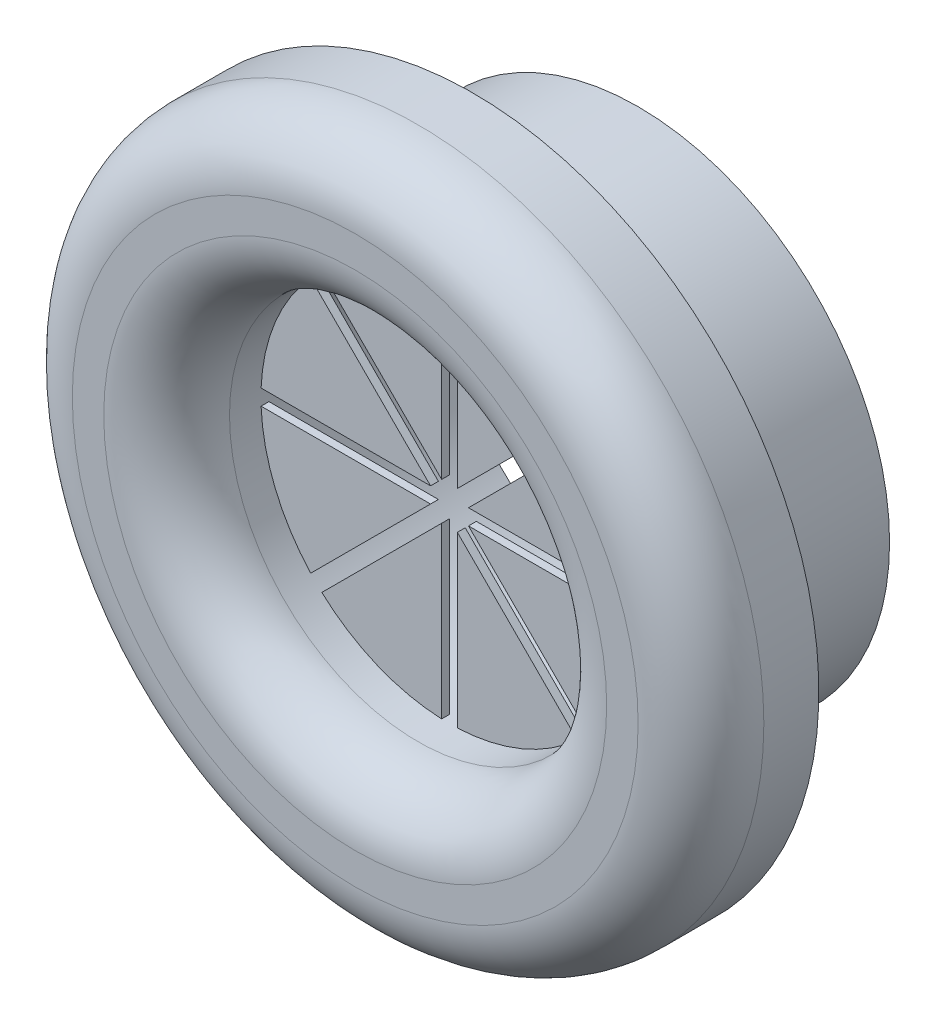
ISO-10303-21;
HEADER;
FILE_DESCRIPTION(('STEP AP214'),'2;1');
FILE_NAME('part.step','',(''),(''),'','','');
FILE_SCHEMA(('AUTOMOTIVE_DESIGN { 1 0 10303 214 1 1 1 1 }'));
ENDSEC;
DATA;
#1=APPLICATION_CONTEXT('core data for automotive mechanical design processes');
#2=APPLICATION_PROTOCOL_DEFINITION('international standard','automotive_design',2000,#1);
#3=PRODUCT_CONTEXT('',#1,'mechanical');
#4=PRODUCT('Part','Part','',(#3));
#5=PRODUCT_RELATED_PRODUCT_CATEGORY('part','',(#4));
#6=PRODUCT_DEFINITION_FORMATION('','',#4);
#7=PRODUCT_DEFINITION_CONTEXT('part definition',#1,'design');
#8=PRODUCT_DEFINITION('design','',#6,#7);
#9=PRODUCT_DEFINITION_SHAPE('','',#8);
#10=(LENGTH_UNIT() NAMED_UNIT(*) SI_UNIT(.MILLI.,.METRE.));
#11=(NAMED_UNIT(*) PLANE_ANGLE_UNIT() SI_UNIT($,.RADIAN.));
#12=(NAMED_UNIT(*) SI_UNIT($,.STERADIAN.) SOLID_ANGLE_UNIT());
#13=UNCERTAINTY_MEASURE_WITH_UNIT(LENGTH_MEASURE(1.E-05),#10,'distance_accuracy_value','');
#14=(GEOMETRIC_REPRESENTATION_CONTEXT(3) GLOBAL_UNCERTAINTY_ASSIGNED_CONTEXT((#13)) GLOBAL_UNIT_ASSIGNED_CONTEXT((#10,
#11,#12)) REPRESENTATION_CONTEXT('',''));
#15=CARTESIAN_POINT('',(0.,0.,0.));
#16=DIRECTION('',(0.,0.,1.));
#17=DIRECTION('',(1.,0.,0.));
#18=AXIS2_PLACEMENT_3D('',#15,#16,#17);
#19=CARTESIAN_POINT('',(0.,0.,9.));
#20=DIRECTION('',(0.,0.,-1.));
#21=DIRECTION('',(-1.,0.,0.));
#22=AXIS2_PLACEMENT_3D('',#19,#20,#21);
#23=CYLINDRICAL_SURFACE('',#22,11.);
#24=CARTESIAN_POINT('',(0.,0.,7.));
#25=DIRECTION('',(0.,0.,1.));
#26=DIRECTION('',(1.,0.,0.));
#27=AXIS2_PLACEMENT_3D('',#24,#25,#26);
#28=CIRCLE('',#27,11.);
#29=CARTESIAN_POINT('',(11.,0.,7.));
#30=VERTEX_POINT('',#29);
#31=EDGE_CURVE('E11',#30,#30,#28,.F.);
#32=ORIENTED_EDGE('',*,*,#31,.T.);
#33=EDGE_LOOP('',(#32));
#34=FACE_BOUND('',#33,.T.);
#35=CARTESIAN_POINT('',(0.,0.,5.25));
#36=DIRECTION('',(0.,0.,-1.));
#37=DIRECTION('',(-1.,0.,0.));
#38=AXIS2_PLACEMENT_3D('',#35,#36,#37);
#39=CIRCLE('',#38,11.);
#40=CARTESIAN_POINT('',(-11.,0.,5.25));
#41=VERTEX_POINT('',#40);
#42=EDGE_CURVE('E214',#41,#41,#39,.T.);
#43=ORIENTED_EDGE('',*,*,#42,.F.);
#44=EDGE_LOOP('',(#43));
#45=FACE_BOUND('',#44,.T.);
#46=ADVANCED_FACE('F33',(#34,#45),#23,.T.);
#47=CARTESIAN_POINT('',(0.,0.,5.));
#48=DIRECTION('',(0.,0.,1.));
#49=DIRECTION('',(1.,0.,0.));
#50=AXIS2_PLACEMENT_3D('',#47,#48,#49);
#51=PLANE('',#50);
#52=CARTESIAN_POINT('',(0.,0.,5.));
#53=DIRECTION('',(0.,0.,1.));
#54=DIRECTION('',(1.,0.,0.));
#55=AXIS2_PLACEMENT_3D('',#52,#53,#54);
#56=CIRCLE('',#55,8.);
#57=CARTESIAN_POINT('',(8.,0.,5.));
#58=VERTEX_POINT('',#57);
#59=EDGE_CURVE('E395',#58,#58,#56,.T.);
#60=ORIENTED_EDGE('',*,*,#59,.T.);
#61=EDGE_LOOP('',(#60));
#62=FACE_BOUND('',#61,.T.);
#63=CARTESIAN_POINT('',(0.,0.,5.));
#64=DIRECTION('',(0.,0.,-1.));
#65=DIRECTION('',(-1.,0.,0.));
#66=AXIS2_PLACEMENT_3D('',#63,#64,#65);
#67=CIRCLE('',#66,10.);
#68=CARTESIAN_POINT('',(-10.,0.,5.));
#69=VERTEX_POINT('',#68);
#70=EDGE_CURVE('E585',#69,#69,#67,.T.);
#71=ORIENTED_EDGE('',*,*,#70,.T.);
#72=EDGE_LOOP('',(#71));
#73=FACE_BOUND('',#72,.T.);
#74=ADVANCED_FACE('F430',(#62,#73),#51,.F.);
#75=CARTESIAN_POINT('',(0.,0.,5.));
#76=DIRECTION('',(0.,0.,-1.));
#77=DIRECTION('',(-1.,0.,0.));
#78=AXIS2_PLACEMENT_3D('',#75,#76,#77);
#79=CYLINDRICAL_SURFACE('',#78,8.);
#80=ORIENTED_EDGE('',*,*,#59,.F.);
#81=EDGE_LOOP('',(#80));
#82=FACE_BOUND('',#81,.T.);
#83=CARTESIAN_POINT('',(0.,0.,0.));
#84=DIRECTION('',(0.,0.,1.));
#85=DIRECTION('',(1.,0.,0.));
#86=AXIS2_PLACEMENT_3D('',#83,#84,#85);
#87=CIRCLE('',#86,8.);
#88=CARTESIAN_POINT('',(8.,0.,0.));
#89=VERTEX_POINT('',#88);
#90=EDGE_CURVE('E394',#89,#89,#87,.T.);
#91=ORIENTED_EDGE('',*,*,#90,.T.);
#92=EDGE_LOOP('',(#91));
#93=FACE_BOUND('',#92,.T.);
#94=ADVANCED_FACE('F425',(#82,#93),#79,.T.);
#95=CARTESIAN_POINT('',(0.,0.,0.));
#96=DIRECTION('',(0.,0.,1.));
#97=DIRECTION('',(1.,0.,0.));
#98=AXIS2_PLACEMENT_3D('',#95,#96,#97);
#99=PLANE('',#98);
#100=CARTESIAN_POINT('',(0.,0.,0.));
#101=DIRECTION('',(0.,0.,1.));
#102=DIRECTION('',(1.,0.,0.));
#103=AXIS2_PLACEMENT_3D('',#100,#101,#102);
#104=CIRCLE('',#103,6.);
#105=CARTESIAN_POINT('',(6.,0.,0.));
#106=VERTEX_POINT('',#105);
#107=EDGE_CURVE('E387',#106,#106,#104,.T.);
#108=ORIENTED_EDGE('',*,*,#107,.T.);
#109=EDGE_LOOP('',(#108));
#110=FACE_BOUND('',#109,.T.);
#111=ORIENTED_EDGE('',*,*,#90,.F.);
#112=EDGE_LOOP('',(#111));
#113=FACE_BOUND('',#112,.T.);
#114=ADVANCED_FACE('F422',(#110,#113),#99,.F.);
#115=CARTESIAN_POINT('',(0.,0.,9.));
#116=DIRECTION('',(0.,0.,1.));
#117=DIRECTION('',(1.,0.,0.));
#118=AXIS2_PLACEMENT_3D('',#115,#116,#117);
#119=PLANE('',#118);
#120=CARTESIAN_POINT('',(0.,0.,9.));
#121=DIRECTION('',(0.,0.,1.));
#122=DIRECTION('',(1.,0.,0.));
#123=AXIS2_PLACEMENT_3D('',#120,#121,#122);
#124=CIRCLE('',#123,8.);
#125=CARTESIAN_POINT('',(8.,0.,9.));
#126=VERTEX_POINT('',#125);
#127=EDGE_CURVE('E41',#126,#126,#124,.F.);
#128=ORIENTED_EDGE('',*,*,#127,.T.);
#129=EDGE_LOOP('',(#128));
#130=FACE_BOUND('',#129,.T.);
#131=CARTESIAN_POINT('',(0.,0.,9.));
#132=DIRECTION('',(0.,0.,1.));
#133=DIRECTION('',(1.,0.,0.));
#134=AXIS2_PLACEMENT_3D('',#131,#132,#133);
#135=CIRCLE('',#134,9.);
#136=CARTESIAN_POINT('',(9.,0.,9.));
#137=VERTEX_POINT('',#136);
#138=EDGE_CURVE('E403',#137,#137,#135,.T.);
#139=ORIENTED_EDGE('',*,*,#138,.T.);
#140=EDGE_LOOP('',(#139));
#141=FACE_BOUND('',#140,.T.);
#142=ADVANCED_FACE('F408',(#130,#141),#119,.T.);
#143=CARTESIAN_POINT('',(0.,0.,0.));
#144=DIRECTION('',(0.,0.,1.));
#145=DIRECTION('',(1.,0.,0.));
#146=AXIS2_PLACEMENT_3D('',#143,#144,#145);
#147=CYLINDRICAL_SURFACE('',#146,6.);
#148=DIRECTION('',(0.,0.,1.));
#149=VECTOR('',#148,1.);
#150=CARTESIAN_POINT('',(-4.41573293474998,4.0621795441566,5.75000000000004));
#151=LINE('',#150,#149);
#152=CARTESIAN_POINT('',(-4.41573293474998,4.0621795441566,5.75));
#153=VERTEX_POINT('',#152);
#154=CARTESIAN_POINT('',(-4.41573293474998,4.0621795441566,6.00000000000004));
#155=VERTEX_POINT('',#154);
#156=EDGE_CURVE('E53',#153,#155,#151,.T.);
#157=ORIENTED_EDGE('',*,*,#156,.F.);
#158=CARTESIAN_POINT('',(0.,0.,5.75));
#159=DIRECTION('',(0.,0.,-1.));
#160=DIRECTION('',(-0.707106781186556,0.707106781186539,0.));
#161=AXIS2_PLACEMENT_3D('',#158,#159,#160);
#162=CIRCLE('',#161,6.00000000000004);
#163=CARTESIAN_POINT('',(-5.9947894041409,0.249999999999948,5.75));
#164=VERTEX_POINT('',#163);
#165=EDGE_CURVE('E48',#164,#153,#162,.T.);
#166=ORIENTED_EDGE('',*,*,#165,.F.);
#167=DIRECTION('',(0.,0.,1.));
#168=VECTOR('',#167,1.);
#169=CARTESIAN_POINT('',(-5.99478940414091,0.24999999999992,5.75000000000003));
#170=LINE('',#169,#168);
#171=CARTESIAN_POINT('',(-5.99478940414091,0.249999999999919,6.00000000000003));
#172=VERTEX_POINT('',#171);
#173=EDGE_CURVE('E209',#164,#172,#170,.T.);
#174=ORIENTED_EDGE('',*,*,#173,.T.);
#175=CARTESIAN_POINT('',(0.,0.,6.));
#176=DIRECTION('',(0.,0.,-1.));
#177=DIRECTION('',(-0.707106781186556,0.707106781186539,0.));
#178=AXIS2_PLACEMENT_3D('',#175,#176,#177);
#179=CIRCLE('',#178,6.00000000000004);
#180=EDGE_CURVE('E210',#172,#155,#179,.T.);
#181=ORIENTED_EDGE('',*,*,#180,.T.);
#182=EDGE_LOOP('',(#157,#166,#174,#181));
#183=FACE_BOUND('',#182,.T.);
#184=DIRECTION('',(0.,0.,1.));
#185=VECTOR('',#184,1.);
#186=CARTESIAN_POINT('',(-0.250000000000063,5.9947894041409,5.75000000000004));
#187=LINE('',#186,#185);
#188=CARTESIAN_POINT('',(-0.250000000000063,5.9947894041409,5.75));
#189=VERTEX_POINT('',#188);
#190=CARTESIAN_POINT('',(-0.250000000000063,5.9947894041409,6.00000000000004));
#191=VERTEX_POINT('',#190);
#192=EDGE_CURVE('E244',#189,#191,#187,.T.);
#193=ORIENTED_EDGE('',*,*,#192,.F.);
#194=CARTESIAN_POINT('',(0.,0.,5.75));
#195=DIRECTION('',(0.,0.,-1.));
#196=DIRECTION('',(0.,1.,0.));
#197=AXIS2_PLACEMENT_3D('',#194,#195,#196);
#198=CIRCLE('',#197,6.00000000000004);
#199=CARTESIAN_POINT('',(-4.06217954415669,4.4157329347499,5.75));
#200=VERTEX_POINT('',#199);
#201=EDGE_CURVE('E231',#200,#189,#198,.T.);
#202=ORIENTED_EDGE('',*,*,#201,.F.);
#203=DIRECTION('',(0.,0.,1.));
#204=VECTOR('',#203,1.);
#205=CARTESIAN_POINT('',(-4.06217954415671,4.41573293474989,5.75000000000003));
#206=LINE('',#205,#204);
#207=CARTESIAN_POINT('',(-4.06217954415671,4.41573293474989,6.00000000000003));
#208=VERTEX_POINT('',#207);
#209=EDGE_CURVE('E241',#200,#208,#206,.T.);
#210=ORIENTED_EDGE('',*,*,#209,.T.);
#211=CARTESIAN_POINT('',(0.,0.,6.));
#212=DIRECTION('',(0.,0.,-1.));
#213=DIRECTION('',(0.,1.,0.));
#214=AXIS2_PLACEMENT_3D('',#211,#212,#213);
#215=CIRCLE('',#214,6.00000000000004);
#216=EDGE_CURVE('E228',#208,#191,#215,.T.);
#217=ORIENTED_EDGE('',*,*,#216,.T.);
#218=EDGE_LOOP('',(#193,#202,#210,#217));
#219=FACE_BOUND('',#218,.T.);
#220=DIRECTION('',(0.,0.,1.));
#221=VECTOR('',#220,1.);
#222=CARTESIAN_POINT('',(4.06217954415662,4.41573293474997,5.75000000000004));
#223=LINE('',#222,#221);
#224=CARTESIAN_POINT('',(4.06217954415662,4.41573293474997,5.75));
#225=VERTEX_POINT('',#224);
#226=CARTESIAN_POINT('',(4.06217954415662,4.41573293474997,6.00000000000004));
#227=VERTEX_POINT('',#226);
#228=EDGE_CURVE('E268',#225,#227,#223,.T.);
#229=ORIENTED_EDGE('',*,*,#228,.F.);
#230=CARTESIAN_POINT('',(0.,0.,5.75));
#231=DIRECTION('',(0.,0.,-1.));
#232=DIRECTION('',(0.707106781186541,0.707106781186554,0.));
#233=AXIS2_PLACEMENT_3D('',#230,#231,#232);
#234=CIRCLE('',#233,6.00000000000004);
#235=CARTESIAN_POINT('',(0.249999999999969,5.9947894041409,5.75));
#236=VERTEX_POINT('',#235);
#237=EDGE_CURVE('E255',#236,#225,#234,.T.);
#238=ORIENTED_EDGE('',*,*,#237,.F.);
#239=DIRECTION('',(0.,0.,1.));
#240=VECTOR('',#239,1.);
#241=CARTESIAN_POINT('',(0.249999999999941,5.99478940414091,5.75000000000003));
#242=LINE('',#241,#240);
#243=CARTESIAN_POINT('',(0.249999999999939,5.99478940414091,6.00000000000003));
#244=VERTEX_POINT('',#243);
#245=EDGE_CURVE('E265',#236,#244,#242,.T.);
#246=ORIENTED_EDGE('',*,*,#245,.T.);
#247=CARTESIAN_POINT('',(0.,0.,6.));
#248=DIRECTION('',(0.,0.,-1.));
#249=DIRECTION('',(0.707106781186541,0.707106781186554,0.));
#250=AXIS2_PLACEMENT_3D('',#247,#248,#249);
#251=CIRCLE('',#250,6.00000000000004);
#252=EDGE_CURVE('E252',#244,#227,#251,.T.);
#253=ORIENTED_EDGE('',*,*,#252,.T.);
#254=EDGE_LOOP('',(#229,#238,#246,#253));
#255=FACE_BOUND('',#254,.T.);
#256=DIRECTION('',(0.,0.,1.));
#257=VECTOR('',#256,1.);
#258=CARTESIAN_POINT('',(5.9947894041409,0.25,5.75000000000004));
#259=LINE('',#258,#257);
#260=CARTESIAN_POINT('',(5.9947894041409,0.25,5.75));
#261=VERTEX_POINT('',#260);
#262=CARTESIAN_POINT('',(5.9947894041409,0.25,6.00000000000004));
#263=VERTEX_POINT('',#262);
#264=EDGE_CURVE('E292',#261,#263,#259,.T.);
#265=ORIENTED_EDGE('',*,*,#264,.F.);
#266=CARTESIAN_POINT('',(0.,0.,5.75));
#267=DIRECTION('',(0.,0.,-1.));
#268=DIRECTION('',(1.,0.,0.));
#269=AXIS2_PLACEMENT_3D('',#266,#267,#268);
#270=CIRCLE('',#269,6.00000000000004);
#271=CARTESIAN_POINT('',(4.41573293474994,4.06217954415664,5.75));
#272=VERTEX_POINT('',#271);
#273=EDGE_CURVE('E279',#272,#261,#270,.T.);
#274=ORIENTED_EDGE('',*,*,#273,.F.);
#275=DIRECTION('',(0.,0.,1.));
#276=VECTOR('',#275,1.);
#277=CARTESIAN_POINT('',(4.41573293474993,4.06217954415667,5.75000000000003));
#278=LINE('',#277,#276);
#279=CARTESIAN_POINT('',(4.41573293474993,4.06217954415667,6.00000000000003));
#280=VERTEX_POINT('',#279);
#281=EDGE_CURVE('E289',#272,#280,#278,.T.);
#282=ORIENTED_EDGE('',*,*,#281,.T.);
#283=CARTESIAN_POINT('',(0.,0.,6.));
#284=DIRECTION('',(0.,0.,-1.));
#285=DIRECTION('',(1.,0.,0.));
#286=AXIS2_PLACEMENT_3D('',#283,#284,#285);
#287=CIRCLE('',#286,6.00000000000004);
#288=EDGE_CURVE('E276',#280,#263,#287,.T.);
#289=ORIENTED_EDGE('',*,*,#288,.T.);
#290=EDGE_LOOP('',(#265,#274,#282,#289));
#291=FACE_BOUND('',#290,.T.);
#292=DIRECTION('',(0.,0.,1.));
#293=VECTOR('',#292,1.);
#294=CARTESIAN_POINT('',(4.41573293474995,-4.06217954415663,5.75000000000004));
#295=LINE('',#294,#293);
#296=CARTESIAN_POINT('',(4.41573293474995,-4.06217954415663,5.75));
#297=VERTEX_POINT('',#296);
#298=CARTESIAN_POINT('',(4.41573293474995,-4.06217954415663,6.00000000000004));
#299=VERTEX_POINT('',#298);
#300=EDGE_CURVE('E316',#297,#299,#295,.T.);
#301=ORIENTED_EDGE('',*,*,#300,.F.);
#302=CARTESIAN_POINT('',(0.,0.,5.75));
#303=DIRECTION('',(0.,0.,-1.));
#304=DIRECTION('',(0.707106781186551,-0.707106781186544,0.));
#305=AXIS2_PLACEMENT_3D('',#302,#303,#304);
#306=CIRCLE('',#305,6.00000000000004);
#307=CARTESIAN_POINT('',(5.9947894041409,-0.24999999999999,5.75));
#308=VERTEX_POINT('',#307);
#309=EDGE_CURVE('E303',#308,#297,#306,.T.);
#310=ORIENTED_EDGE('',*,*,#309,.F.);
#311=DIRECTION('',(0.,0.,1.));
#312=VECTOR('',#311,1.);
#313=CARTESIAN_POINT('',(5.99478940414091,-0.249999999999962,5.75000000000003));
#314=LINE('',#313,#312);
#315=CARTESIAN_POINT('',(5.99478940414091,-0.24999999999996,6.00000000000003));
#316=VERTEX_POINT('',#315);
#317=EDGE_CURVE('E313',#308,#316,#314,.T.);
#318=ORIENTED_EDGE('',*,*,#317,.T.);
#319=CARTESIAN_POINT('',(0.,0.,6.));
#320=DIRECTION('',(0.,0.,-1.));
#321=DIRECTION('',(0.707106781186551,-0.707106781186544,0.));
#322=AXIS2_PLACEMENT_3D('',#319,#320,#321);
#323=CIRCLE('',#322,6.00000000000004);
#324=EDGE_CURVE('E300',#316,#299,#323,.T.);
#325=ORIENTED_EDGE('',*,*,#324,.T.);
#326=EDGE_LOOP('',(#301,#310,#318,#325));
#327=FACE_BOUND('',#326,.T.);
#328=DIRECTION('',(0.,0.,1.));
#329=VECTOR('',#328,1.);
#330=CARTESIAN_POINT('',(0.250000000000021,-5.9947894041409,5.75000000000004));
#331=LINE('',#330,#329);
#332=CARTESIAN_POINT('',(0.250000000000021,-5.9947894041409,5.75));
#333=VERTEX_POINT('',#332);
#334=CARTESIAN_POINT('',(0.250000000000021,-5.9947894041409,6.00000000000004));
#335=VERTEX_POINT('',#334);
#336=EDGE_CURVE('E340',#333,#335,#331,.T.);
#337=ORIENTED_EDGE('',*,*,#336,.F.);
#338=CARTESIAN_POINT('',(0.,0.,5.75));
#339=DIRECTION('',(0.,0.,-1.));
#340=DIRECTION('',(0.,-1.,0.));
#341=AXIS2_PLACEMENT_3D('',#338,#339,#340);
#342=CIRCLE('',#341,6.00000000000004);
#343=CARTESIAN_POINT('',(4.06217954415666,-4.41573293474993,5.75));
#344=VERTEX_POINT('',#343);
#345=EDGE_CURVE('E327',#344,#333,#342,.T.);
#346=ORIENTED_EDGE('',*,*,#345,.F.);
#347=DIRECTION('',(0.,0.,1.));
#348=VECTOR('',#347,1.);
#349=CARTESIAN_POINT('',(4.06217954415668,-4.41573293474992,5.75000000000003));
#350=LINE('',#349,#348);
#351=CARTESIAN_POINT('',(4.06217954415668,-4.41573293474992,6.00000000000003));
#352=VERTEX_POINT('',#351);
#353=EDGE_CURVE('E337',#344,#352,#350,.T.);
#354=ORIENTED_EDGE('',*,*,#353,.T.);
#355=CARTESIAN_POINT('',(0.,0.,6.));
#356=DIRECTION('',(0.,0.,-1.));
#357=DIRECTION('',(0.,-1.,0.));
#358=AXIS2_PLACEMENT_3D('',#355,#356,#357);
#359=CIRCLE('',#358,6.00000000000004);
#360=EDGE_CURVE('E324',#352,#335,#359,.T.);
#361=ORIENTED_EDGE('',*,*,#360,.T.);
#362=EDGE_LOOP('',(#337,#346,#354,#361));
#363=FACE_BOUND('',#362,.T.);
#364=DIRECTION('',(0.,0.,1.));
#365=VECTOR('',#364,1.);
#366=CARTESIAN_POINT('',(-4.06217954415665,-4.41573293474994,5.75000000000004));
#367=LINE('',#366,#365);
#368=CARTESIAN_POINT('',(-4.06217954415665,-4.41573293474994,5.75));
#369=VERTEX_POINT('',#368);
#370=CARTESIAN_POINT('',(-4.06217954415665,-4.41573293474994,6.00000000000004));
#371=VERTEX_POINT('',#370);
#372=EDGE_CURVE('E364',#369,#371,#367,.T.);
#373=ORIENTED_EDGE('',*,*,#372,.F.);
#374=CARTESIAN_POINT('',(0.,0.,5.75));
#375=DIRECTION('',(0.,0.,-1.));
#376=DIRECTION('',(-0.707106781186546,-0.707106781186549,0.));
#377=AXIS2_PLACEMENT_3D('',#374,#375,#376);
#378=CIRCLE('',#377,6.00000000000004);
#379=CARTESIAN_POINT('',(-0.25000000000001,-5.9947894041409,5.75));
#380=VERTEX_POINT('',#379);
#381=EDGE_CURVE('E351',#380,#369,#378,.T.);
#382=ORIENTED_EDGE('',*,*,#381,.F.);
#383=DIRECTION('',(0.,0.,1.));
#384=VECTOR('',#383,1.);
#385=CARTESIAN_POINT('',(-0.249999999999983,-5.99478940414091,5.75000000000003));
#386=LINE('',#385,#384);
#387=CARTESIAN_POINT('',(-0.249999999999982,-5.99478940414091,6.00000000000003));
#388=VERTEX_POINT('',#387);
#389=EDGE_CURVE('E361',#380,#388,#386,.T.);
#390=ORIENTED_EDGE('',*,*,#389,.T.);
#391=CARTESIAN_POINT('',(0.,0.,6.));
#392=DIRECTION('',(0.,0.,-1.));
#393=DIRECTION('',(-0.707106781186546,-0.707106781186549,0.));
#394=AXIS2_PLACEMENT_3D('',#391,#392,#393);
#395=CIRCLE('',#394,6.00000000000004);
#396=EDGE_CURVE('E348',#388,#371,#395,.T.);
#397=ORIENTED_EDGE('',*,*,#396,.T.);
#398=EDGE_LOOP('',(#373,#382,#390,#397));
#399=FACE_BOUND('',#398,.T.);
#400=DIRECTION('',(0.,0.,1.));
#401=VECTOR('',#400,1.);
#402=CARTESIAN_POINT('',(-5.9947894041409,-0.25,5.75000000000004));
#403=LINE('',#402,#401);
#404=CARTESIAN_POINT('',(-5.9947894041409,-0.25,5.75));
#405=VERTEX_POINT('',#404);
#406=CARTESIAN_POINT('',(-5.9947894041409,-0.25,6.00000000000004));
#407=VERTEX_POINT('',#406);
#408=EDGE_CURVE('E388',#405,#407,#403,.T.);
#409=ORIENTED_EDGE('',*,*,#408,.F.);
#410=CARTESIAN_POINT('',(0.,0.,5.75));
#411=DIRECTION('',(0.,0.,-1.));
#412=DIRECTION('',(-1.,0.,0.));
#413=AXIS2_PLACEMENT_3D('',#410,#411,#412);
#414=CIRCLE('',#413,6.00000000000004);
#415=CARTESIAN_POINT('',(-4.41573293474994,-4.06217954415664,5.75));
#416=VERTEX_POINT('',#415);
#417=EDGE_CURVE('E375',#416,#405,#414,.T.);
#418=ORIENTED_EDGE('',*,*,#417,.F.);
#419=DIRECTION('',(0.,0.,1.));
#420=VECTOR('',#419,1.);
#421=CARTESIAN_POINT('',(-4.41573293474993,-4.06217954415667,5.75000000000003));
#422=LINE('',#421,#420);
#423=CARTESIAN_POINT('',(-4.41573293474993,-4.06217954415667,6.00000000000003));
#424=VERTEX_POINT('',#423);
#425=EDGE_CURVE('E385',#416,#424,#422,.T.);
#426=ORIENTED_EDGE('',*,*,#425,.T.);
#427=CARTESIAN_POINT('',(0.,0.,6.));
#428=DIRECTION('',(0.,0.,-1.));
#429=DIRECTION('',(-1.,0.,0.));
#430=AXIS2_PLACEMENT_3D('',#427,#428,#429);
#431=CIRCLE('',#430,6.00000000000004);
#432=EDGE_CURVE('E372',#424,#407,#431,.T.);
#433=ORIENTED_EDGE('',*,*,#432,.T.);
#434=EDGE_LOOP('',(#409,#418,#426,#433));
#435=FACE_BOUND('',#434,.T.);
#436=CARTESIAN_POINT('',(0.,0.,7.));
#437=DIRECTION('',(0.,0.,1.));
#438=DIRECTION('',(1.,0.,0.));
#439=AXIS2_PLACEMENT_3D('',#436,#437,#438);
#440=CIRCLE('',#439,6.);
#441=CARTESIAN_POINT('',(6.,0.,7.));
#442=VERTEX_POINT('',#441);
#443=EDGE_CURVE('E398',#442,#442,#440,.T.);
#444=ORIENTED_EDGE('',*,*,#443,.T.);
#445=EDGE_LOOP('',(#444));
#446=FACE_BOUND('',#445,.T.);
#447=ORIENTED_EDGE('',*,*,#107,.F.);
#448=EDGE_LOOP('',(#447));
#449=FACE_BOUND('',#448,.T.);
#450=ADVANCED_FACE('F414',(#183,#219,#255,#291,#327,#363,#399,#435,#446,#449),#147,.F.);
#451=CARTESIAN_POINT('',(0.,0.,7.));
#452=DIRECTION('',(0.,0.,1.));
#453=DIRECTION('',(1.,0.,0.));
#454=AXIS2_PLACEMENT_3D('',#451,#452,#453);
#455=TOROIDAL_SURFACE('',#454,8.,2.);
#456=ORIENTED_EDGE('',*,*,#127,.F.);
#457=EDGE_LOOP('',(#456));
#458=FACE_BOUND('',#457,.T.);
#459=ORIENTED_EDGE('',*,*,#443,.F.);
#460=EDGE_LOOP('',(#459));
#461=FACE_BOUND('',#460,.T.);
#462=ADVANCED_FACE('F411',(#458,#461),#455,.T.);
#463=CARTESIAN_POINT('',(0.,0.,7.));
#464=DIRECTION('',(0.,0.,1.));
#465=DIRECTION('',(1.,0.,0.));
#466=AXIS2_PLACEMENT_3D('',#463,#464,#465);
#467=TOROIDAL_SURFACE('',#466,9.,2.);
#468=ORIENTED_EDGE('',*,*,#31,.F.);
#469=EDGE_LOOP('',(#468));
#470=FACE_BOUND('',#469,.T.);
#471=ORIENTED_EDGE('',*,*,#138,.F.);
#472=EDGE_LOOP('',(#471));
#473=FACE_BOUND('',#472,.T.);
#474=ADVANCED_FACE('F35',(#470,#473),#467,.T.);
#475=CARTESIAN_POINT('',(-4.41573293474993,-4.06217954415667,5.75000000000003));
#476=DIRECTION('',(0.707106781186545,-0.70710678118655,0.));
#477=DIRECTION('',(0.70710678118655,0.707106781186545,0.));
#478=AXIS2_PLACEMENT_3D('',#475,#476,#477);
#479=PLANE('',#478);
#480=DIRECTION('',(0.70710678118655,0.707106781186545,0.));
#481=VECTOR('',#480,1.);
#482=CARTESIAN_POINT('',(-4.41573293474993,-4.06217954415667,6.00000000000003));
#483=LINE('',#482,#481);
#484=CARTESIAN_POINT('',(-0.603553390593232,-0.25,6.));
#485=VERTEX_POINT('',#484);
#486=EDGE_CURVE('E363',#424,#485,#483,.T.);
#487=ORIENTED_EDGE('',*,*,#486,.F.);
#488=ORIENTED_EDGE('',*,*,#425,.F.);
#489=DIRECTION('',(0.70710678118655,0.707106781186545,0.));
#490=VECTOR('',#489,1.);
#491=CARTESIAN_POINT('',(-4.41573293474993,-4.06217954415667,5.75000000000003));
#492=LINE('',#491,#490);
#493=CARTESIAN_POINT('',(-0.603553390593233,-0.25,5.75));
#494=VERTEX_POINT('',#493);
#495=EDGE_CURVE('E368',#416,#494,#492,.T.);
#496=ORIENTED_EDGE('',*,*,#495,.T.);
#497=DIRECTION('',(0.,0.,1.));
#498=VECTOR('',#497,1.);
#499=CARTESIAN_POINT('',(-0.603553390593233,-0.25,5.75));
#500=LINE('',#499,#498);
#501=EDGE_CURVE('E378',#494,#485,#500,.T.);
#502=ORIENTED_EDGE('',*,*,#501,.T.);
#503=EDGE_LOOP('',(#487,#488,#496,#502));
#504=FACE_BOUND('',#503,.T.);
#505=ADVANCED_FACE('F448',(#504),#479,.T.);
#506=CARTESIAN_POINT('',(-0.603553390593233,-0.25,5.75));
#507=DIRECTION('',(0.,1.,0.));
#508=DIRECTION('',(-1.,0.,0.));
#509=AXIS2_PLACEMENT_3D('',#506,#507,#508);
#510=PLANE('',#509);
#511=DIRECTION('',(-1.,0.,0.));
#512=VECTOR('',#511,1.);
#513=CARTESIAN_POINT('',(-0.603553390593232,-0.25,6.));
#514=LINE('',#513,#512);
#515=EDGE_CURVE('E381',#485,#407,#514,.T.);
#516=ORIENTED_EDGE('',*,*,#515,.F.);
#517=ORIENTED_EDGE('',*,*,#501,.F.);
#518=DIRECTION('',(-1.,0.,0.));
#519=VECTOR('',#518,1.);
#520=CARTESIAN_POINT('',(-0.603553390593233,-0.25,5.75));
#521=LINE('',#520,#519);
#522=EDGE_CURVE('E371',#494,#405,#521,.T.);
#523=ORIENTED_EDGE('',*,*,#522,.T.);
#524=ORIENTED_EDGE('',*,*,#408,.T.);
#525=EDGE_LOOP('',(#516,#517,#523,#524));
#526=FACE_BOUND('',#525,.T.);
#527=ADVANCED_FACE('F451',(#526),#510,.T.);
#528=CARTESIAN_POINT('',(0.,0.,5.75));
#529=DIRECTION('',(0.,0.,-1.));
#530=DIRECTION('',(-1.,0.,0.));
#531=AXIS2_PLACEMENT_3D('',#528,#529,#530);
#532=PLANE('',#531);
#533=ORIENTED_EDGE('',*,*,#495,.F.);
#534=ORIENTED_EDGE('',*,*,#417,.T.);
#535=ORIENTED_EDGE('',*,*,#522,.F.);
#536=EDGE_LOOP('',(#533,#534,#535));
#537=FACE_BOUND('',#536,.T.);
#538=ADVANCED_FACE('F455',(#537),#532,.T.);
#539=CARTESIAN_POINT('',(0.,0.,6.));
#540=DIRECTION('',(0.,0.,-1.));
#541=DIRECTION('',(-1.,0.,0.));
#542=AXIS2_PLACEMENT_3D('',#539,#540,#541);
#543=PLANE('',#542);
#544=ORIENTED_EDGE('',*,*,#486,.T.);
#545=ORIENTED_EDGE('',*,*,#515,.T.);
#546=ORIENTED_EDGE('',*,*,#432,.F.);
#547=EDGE_LOOP('',(#544,#545,#546));
#548=FACE_BOUND('',#547,.T.);
#549=ADVANCED_FACE('F457',(#548),#543,.F.);
#550=CARTESIAN_POINT('',(-0.249999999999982,-5.99478940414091,5.75000000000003));
#551=DIRECTION('',(1.,0.,0.));
#552=DIRECTION('',(0.,0.,-1.));
#553=AXIS2_PLACEMENT_3D('',#550,#551,#552);
#554=PLANE('',#553);
#555=DIRECTION('',(0.,1.,0.));
#556=VECTOR('',#555,1.);
#557=CARTESIAN_POINT('',(-0.249999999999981,-5.99478940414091,6.00000000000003));
#558=LINE('',#557,#556);
#559=CARTESIAN_POINT('',(-0.249999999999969,-0.603553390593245,6.));
#560=VERTEX_POINT('',#559);
#561=EDGE_CURVE('E339',#388,#560,#558,.T.);
#562=ORIENTED_EDGE('',*,*,#561,.F.);
#563=ORIENTED_EDGE('',*,*,#389,.F.);
#564=DIRECTION('',(0.,1.,0.));
#565=VECTOR('',#564,1.);
#566=CARTESIAN_POINT('',(-0.249999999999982,-5.99478940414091,5.75000000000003));
#567=LINE('',#566,#565);
#568=CARTESIAN_POINT('',(-0.24999999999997,-0.603553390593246,5.75));
#569=VERTEX_POINT('',#568);
#570=EDGE_CURVE('E344',#380,#569,#567,.T.);
#571=ORIENTED_EDGE('',*,*,#570,.T.);
#572=DIRECTION('',(0.,0.,1.));
#573=VECTOR('',#572,1.);
#574=CARTESIAN_POINT('',(-0.24999999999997,-0.603553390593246,5.75));
#575=LINE('',#574,#573);
#576=EDGE_CURVE('E354',#569,#560,#575,.T.);
#577=ORIENTED_EDGE('',*,*,#576,.T.);
#578=EDGE_LOOP('',(#562,#563,#571,#577));
#579=FACE_BOUND('',#578,.T.);
#580=ADVANCED_FACE('F460',(#579),#554,.T.);
#581=CARTESIAN_POINT('',(-0.24999999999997,-0.603553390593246,5.75));
#582=DIRECTION('',(-0.707106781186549,0.707106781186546,0.));
#583=DIRECTION('',(-0.707106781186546,-0.707106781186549,0.));
#584=AXIS2_PLACEMENT_3D('',#581,#582,#583);
#585=PLANE('',#584);
#586=DIRECTION('',(-0.707106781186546,-0.707106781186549,0.));
#587=VECTOR('',#586,1.);
#588=CARTESIAN_POINT('',(-0.249999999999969,-0.603553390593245,6.));
#589=LINE('',#588,#587);
#590=EDGE_CURVE('E357',#560,#371,#589,.T.);
#591=ORIENTED_EDGE('',*,*,#590,.F.);
#592=ORIENTED_EDGE('',*,*,#576,.F.);
#593=DIRECTION('',(-0.707106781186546,-0.707106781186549,0.));
#594=VECTOR('',#593,1.);
#595=CARTESIAN_POINT('',(-0.24999999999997,-0.603553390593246,5.75));
#596=LINE('',#595,#594);
#597=EDGE_CURVE('E347',#569,#369,#596,.T.);
#598=ORIENTED_EDGE('',*,*,#597,.T.);
#599=ORIENTED_EDGE('',*,*,#372,.T.);
#600=EDGE_LOOP('',(#591,#592,#598,#599));
#601=FACE_BOUND('',#600,.T.);
#602=ADVANCED_FACE('F467',(#601),#585,.T.);
#603=CARTESIAN_POINT('',(0.,0.,5.75));
#604=DIRECTION('',(0.,0.,-1.));
#605=DIRECTION('',(-0.707106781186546,-0.707106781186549,0.));
#606=AXIS2_PLACEMENT_3D('',#603,#604,#605);
#607=PLANE('',#606);
#608=ORIENTED_EDGE('',*,*,#570,.F.);
#609=ORIENTED_EDGE('',*,*,#381,.T.);
#610=ORIENTED_EDGE('',*,*,#597,.F.);
#611=EDGE_LOOP('',(#608,#609,#610));
#612=FACE_BOUND('',#611,.T.);
#613=ADVANCED_FACE('F471',(#612),#607,.T.);
#614=CARTESIAN_POINT('',(0.,0.,6.));
#615=DIRECTION('',(0.,0.,-1.));
#616=DIRECTION('',(-0.707106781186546,-0.707106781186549,0.));
#617=AXIS2_PLACEMENT_3D('',#614,#615,#616);
#618=PLANE('',#617);
#619=ORIENTED_EDGE('',*,*,#561,.T.);
#620=ORIENTED_EDGE('',*,*,#590,.T.);
#621=ORIENTED_EDGE('',*,*,#396,.F.);
#622=EDGE_LOOP('',(#619,#620,#621));
#623=FACE_BOUND('',#622,.T.);
#624=ADVANCED_FACE('F473',(#623),#618,.F.);
#625=CARTESIAN_POINT('',(4.06217954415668,-4.41573293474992,5.75000000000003));
#626=DIRECTION('',(0.707106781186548,0.707106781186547,0.));
#627=DIRECTION('',(-0.707106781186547,0.707106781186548,0.));
#628=AXIS2_PLACEMENT_3D('',#625,#626,#627);
#629=PLANE('',#628);
#630=DIRECTION('',(-0.707106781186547,0.707106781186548,0.));
#631=VECTOR('',#630,1.);
#632=CARTESIAN_POINT('',(4.06217954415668,-4.41573293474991,6.00000000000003));
#633=LINE('',#632,#631);
#634=CARTESIAN_POINT('',(0.250000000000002,-0.603553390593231,6.));
#635=VERTEX_POINT('',#634);
#636=EDGE_CURVE('E315',#352,#635,#633,.T.);
#637=ORIENTED_EDGE('',*,*,#636,.F.);
#638=ORIENTED_EDGE('',*,*,#353,.F.);
#639=DIRECTION('',(-0.707106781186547,0.707106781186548,0.));
#640=VECTOR('',#639,1.);
#641=CARTESIAN_POINT('',(4.06217954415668,-4.41573293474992,5.75000000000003));
#642=LINE('',#641,#640);
#643=CARTESIAN_POINT('',(0.250000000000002,-0.603553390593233,5.75));
#644=VERTEX_POINT('',#643);
#645=EDGE_CURVE('E320',#344,#644,#642,.T.);
#646=ORIENTED_EDGE('',*,*,#645,.T.);
#647=DIRECTION('',(0.,0.,1.));
#648=VECTOR('',#647,1.);
#649=CARTESIAN_POINT('',(0.250000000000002,-0.603553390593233,5.75));
#650=LINE('',#649,#648);
#651=EDGE_CURVE('E330',#644,#635,#650,.T.);
#652=ORIENTED_EDGE('',*,*,#651,.T.);
#653=EDGE_LOOP('',(#637,#638,#646,#652));
#654=FACE_BOUND('',#653,.T.);
#655=ADVANCED_FACE('F476',(#654),#629,.T.);
#656=CARTESIAN_POINT('',(0.250000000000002,-0.603553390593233,5.75));
#657=DIRECTION('',(-1.,0.,0.));
#658=DIRECTION('',(0.,-1.,0.));
#659=AXIS2_PLACEMENT_3D('',#656,#657,#658);
#660=PLANE('',#659);
#661=DIRECTION('',(0.,-1.,0.));
#662=VECTOR('',#661,1.);
#663=CARTESIAN_POINT('',(0.250000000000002,-0.603553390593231,6.));
#664=LINE('',#663,#662);
#665=EDGE_CURVE('E333',#635,#335,#664,.T.);
#666=ORIENTED_EDGE('',*,*,#665,.F.);
#667=ORIENTED_EDGE('',*,*,#651,.F.);
#668=DIRECTION('',(0.,-1.,0.));
#669=VECTOR('',#668,1.);
#670=CARTESIAN_POINT('',(0.250000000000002,-0.603553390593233,5.75));
#671=LINE('',#670,#669);
#672=EDGE_CURVE('E323',#644,#333,#671,.T.);
#673=ORIENTED_EDGE('',*,*,#672,.T.);
#674=ORIENTED_EDGE('',*,*,#336,.T.);
#675=EDGE_LOOP('',(#666,#667,#673,#674));
#676=FACE_BOUND('',#675,.T.);
#677=ADVANCED_FACE('F483',(#676),#660,.T.);
#678=CARTESIAN_POINT('',(0.,0.,5.75));
#679=DIRECTION('',(0.,0.,-1.));
#680=DIRECTION('',(0.,-1.,0.));
#681=AXIS2_PLACEMENT_3D('',#678,#679,#680);
#682=PLANE('',#681);
#683=ORIENTED_EDGE('',*,*,#645,.F.);
#684=ORIENTED_EDGE('',*,*,#345,.T.);
#685=ORIENTED_EDGE('',*,*,#672,.F.);
#686=EDGE_LOOP('',(#683,#684,#685));
#687=FACE_BOUND('',#686,.T.);
#688=ADVANCED_FACE('F487',(#687),#682,.T.);
#689=CARTESIAN_POINT('',(0.,0.,6.));
#690=DIRECTION('',(0.,0.,-1.));
#691=DIRECTION('',(0.,-1.,0.));
#692=AXIS2_PLACEMENT_3D('',#689,#690,#691);
#693=PLANE('',#692);
#694=ORIENTED_EDGE('',*,*,#636,.T.);
#695=ORIENTED_EDGE('',*,*,#665,.T.);
#696=ORIENTED_EDGE('',*,*,#360,.F.);
#697=EDGE_LOOP('',(#694,#695,#696));
#698=FACE_BOUND('',#697,.T.);
#699=ADVANCED_FACE('F489',(#698),#693,.F.);
#700=CARTESIAN_POINT('',(5.99478940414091,-0.249999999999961,5.75000000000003));
#701=DIRECTION('',(0.,1.,0.));
#702=DIRECTION('',(0.,0.,1.));
#703=AXIS2_PLACEMENT_3D('',#700,#701,#702);
#704=PLANE('',#703);
#705=DIRECTION('',(-1.,0.,0.));
#706=VECTOR('',#705,1.);
#707=CARTESIAN_POINT('',(5.99478940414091,-0.24999999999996,6.00000000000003));
#708=LINE('',#707,#706);
#709=CARTESIAN_POINT('',(0.603553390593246,-0.249999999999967,6.));
#710=VERTEX_POINT('',#709);
#711=EDGE_CURVE('E291',#316,#710,#708,.T.);
#712=ORIENTED_EDGE('',*,*,#711,.F.);
#713=ORIENTED_EDGE('',*,*,#317,.F.);
#714=DIRECTION('',(-1.,0.,0.));
#715=VECTOR('',#714,1.);
#716=CARTESIAN_POINT('',(5.99478940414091,-0.249999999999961,5.75000000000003));
#717=LINE('',#716,#715);
#718=CARTESIAN_POINT('',(0.603553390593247,-0.249999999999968,5.75));
#719=VERTEX_POINT('',#718);
#720=EDGE_CURVE('E296',#308,#719,#717,.T.);
#721=ORIENTED_EDGE('',*,*,#720,.T.);
#722=DIRECTION('',(0.,0.,1.));
#723=VECTOR('',#722,1.);
#724=CARTESIAN_POINT('',(0.603553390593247,-0.249999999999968,5.75));
#725=LINE('',#724,#723);
#726=EDGE_CURVE('E306',#719,#710,#725,.T.);
#727=ORIENTED_EDGE('',*,*,#726,.T.);
#728=EDGE_LOOP('',(#712,#713,#721,#727));
#729=FACE_BOUND('',#728,.T.);
#730=ADVANCED_FACE('F492',(#729),#704,.T.);
#731=CARTESIAN_POINT('',(0.603553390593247,-0.249999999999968,5.75));
#732=DIRECTION('',(-0.707106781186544,-0.707106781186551,0.));
#733=DIRECTION('',(0.707106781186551,-0.707106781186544,0.));
#734=AXIS2_PLACEMENT_3D('',#731,#732,#733);
#735=PLANE('',#734);
#736=DIRECTION('',(0.707106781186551,-0.707106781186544,0.));
#737=VECTOR('',#736,1.);
#738=CARTESIAN_POINT('',(0.603553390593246,-0.249999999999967,6.));
#739=LINE('',#738,#737);
#740=EDGE_CURVE('E309',#710,#299,#739,.T.);
#741=ORIENTED_EDGE('',*,*,#740,.F.);
#742=ORIENTED_EDGE('',*,*,#726,.F.);
#743=DIRECTION('',(0.707106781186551,-0.707106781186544,0.));
#744=VECTOR('',#743,1.);
#745=CARTESIAN_POINT('',(0.603553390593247,-0.249999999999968,5.75));
#746=LINE('',#745,#744);
#747=EDGE_CURVE('E299',#719,#297,#746,.T.);
#748=ORIENTED_EDGE('',*,*,#747,.T.);
#749=ORIENTED_EDGE('',*,*,#300,.T.);
#750=EDGE_LOOP('',(#741,#742,#748,#749));
#751=FACE_BOUND('',#750,.T.);
#752=ADVANCED_FACE('F499',(#751),#735,.T.);
#753=CARTESIAN_POINT('',(0.,0.,5.75));
#754=DIRECTION('',(0.,0.,-1.));
#755=DIRECTION('',(0.707106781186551,-0.707106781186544,0.));
#756=AXIS2_PLACEMENT_3D('',#753,#754,#755);
#757=PLANE('',#756);
#758=ORIENTED_EDGE('',*,*,#720,.F.);
#759=ORIENTED_EDGE('',*,*,#309,.T.);
#760=ORIENTED_EDGE('',*,*,#747,.F.);
#761=EDGE_LOOP('',(#758,#759,#760));
#762=FACE_BOUND('',#761,.T.);
#763=ADVANCED_FACE('F503',(#762),#757,.T.);
#764=CARTESIAN_POINT('',(0.,0.,6.));
#765=DIRECTION('',(0.,0.,-1.));
#766=DIRECTION('',(0.707106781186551,-0.707106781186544,0.));
#767=AXIS2_PLACEMENT_3D('',#764,#765,#766);
#768=PLANE('',#767);
#769=ORIENTED_EDGE('',*,*,#711,.T.);
#770=ORIENTED_EDGE('',*,*,#740,.T.);
#771=ORIENTED_EDGE('',*,*,#324,.F.);
#772=EDGE_LOOP('',(#769,#770,#771));
#773=FACE_BOUND('',#772,.T.);
#774=ADVANCED_FACE('F505',(#773),#768,.F.);
#775=CARTESIAN_POINT('',(4.41573293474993,4.06217954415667,5.75000000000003));
#776=DIRECTION('',(-0.707106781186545,0.70710678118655,0.));
#777=DIRECTION('',(-0.70710678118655,-0.707106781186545,0.));
#778=AXIS2_PLACEMENT_3D('',#775,#776,#777);
#779=PLANE('',#778);
#780=DIRECTION('',(-0.70710678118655,-0.707106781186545,0.));
#781=VECTOR('',#780,1.);
#782=CARTESIAN_POINT('',(4.41573293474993,4.06217954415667,6.00000000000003));
#783=LINE('',#782,#781);
#784=CARTESIAN_POINT('',(0.603553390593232,0.25,6.));
#785=VERTEX_POINT('',#784);
#786=EDGE_CURVE('E267',#280,#785,#783,.T.);
#787=ORIENTED_EDGE('',*,*,#786,.F.);
#788=ORIENTED_EDGE('',*,*,#281,.F.);
#789=DIRECTION('',(-0.70710678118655,-0.707106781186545,0.));
#790=VECTOR('',#789,1.);
#791=CARTESIAN_POINT('',(4.41573293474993,4.06217954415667,5.75000000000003));
#792=LINE('',#791,#790);
#793=CARTESIAN_POINT('',(0.603553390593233,0.25,5.75));
#794=VERTEX_POINT('',#793);
#795=EDGE_CURVE('E272',#272,#794,#792,.T.);
#796=ORIENTED_EDGE('',*,*,#795,.T.);
#797=DIRECTION('',(0.,0.,1.));
#798=VECTOR('',#797,1.);
#799=CARTESIAN_POINT('',(0.603553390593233,0.25,5.75));
#800=LINE('',#799,#798);
#801=EDGE_CURVE('E282',#794,#785,#800,.T.);
#802=ORIENTED_EDGE('',*,*,#801,.T.);
#803=EDGE_LOOP('',(#787,#788,#796,#802));
#804=FACE_BOUND('',#803,.T.);
#805=ADVANCED_FACE('F508',(#804),#779,.T.);
#806=CARTESIAN_POINT('',(0.603553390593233,0.25,5.75));
#807=DIRECTION('',(0.,-1.,0.));
#808=DIRECTION('',(1.,0.,0.));
#809=AXIS2_PLACEMENT_3D('',#806,#807,#808);
#810=PLANE('',#809);
#811=DIRECTION('',(1.,0.,0.));
#812=VECTOR('',#811,1.);
#813=CARTESIAN_POINT('',(0.603553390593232,0.25,6.));
#814=LINE('',#813,#812);
#815=EDGE_CURVE('E285',#785,#263,#814,.T.);
#816=ORIENTED_EDGE('',*,*,#815,.F.);
#817=ORIENTED_EDGE('',*,*,#801,.F.);
#818=DIRECTION('',(1.,0.,0.));
#819=VECTOR('',#818,1.);
#820=CARTESIAN_POINT('',(0.603553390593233,0.25,5.75));
#821=LINE('',#820,#819);
#822=EDGE_CURVE('E275',#794,#261,#821,.T.);
#823=ORIENTED_EDGE('',*,*,#822,.T.);
#824=ORIENTED_EDGE('',*,*,#264,.T.);
#825=EDGE_LOOP('',(#816,#817,#823,#824));
#826=FACE_BOUND('',#825,.T.);
#827=ADVANCED_FACE('F515',(#826),#810,.T.);
#828=CARTESIAN_POINT('',(0.,0.,5.75));
#829=DIRECTION('',(0.,0.,-1.));
#830=DIRECTION('',(1.,0.,0.));
#831=AXIS2_PLACEMENT_3D('',#828,#829,#830);
#832=PLANE('',#831);
#833=ORIENTED_EDGE('',*,*,#795,.F.);
#834=ORIENTED_EDGE('',*,*,#273,.T.);
#835=ORIENTED_EDGE('',*,*,#822,.F.);
#836=EDGE_LOOP('',(#833,#834,#835));
#837=FACE_BOUND('',#836,.T.);
#838=ADVANCED_FACE('F519',(#837),#832,.T.);
#839=CARTESIAN_POINT('',(0.,0.,6.));
#840=DIRECTION('',(0.,0.,-1.));
#841=DIRECTION('',(1.,0.,0.));
#842=AXIS2_PLACEMENT_3D('',#839,#840,#841);
#843=PLANE('',#842);
#844=ORIENTED_EDGE('',*,*,#786,.T.);
#845=ORIENTED_EDGE('',*,*,#815,.T.);
#846=ORIENTED_EDGE('',*,*,#288,.F.);
#847=EDGE_LOOP('',(#844,#845,#846));
#848=FACE_BOUND('',#847,.T.);
#849=ADVANCED_FACE('F521',(#848),#843,.F.);
#850=CARTESIAN_POINT('',(0.24999999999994,5.99478940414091,5.75000000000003));
#851=DIRECTION('',(-1.,0.,0.));
#852=DIRECTION('',(0.,0.,1.));
#853=AXIS2_PLACEMENT_3D('',#850,#851,#852);
#854=PLANE('',#853);
#855=DIRECTION('',(0.,-1.,0.));
#856=VECTOR('',#855,1.);
#857=CARTESIAN_POINT('',(0.249999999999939,5.99478940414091,6.00000000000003));
#858=LINE('',#857,#856);
#859=CARTESIAN_POINT('',(0.249999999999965,0.603553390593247,6.));
#860=VERTEX_POINT('',#859);
#861=EDGE_CURVE('E243',#244,#860,#858,.T.);
#862=ORIENTED_EDGE('',*,*,#861,.F.);
#863=ORIENTED_EDGE('',*,*,#245,.F.);
#864=DIRECTION('',(0.,-1.,0.));
#865=VECTOR('',#864,1.);
#866=CARTESIAN_POINT('',(0.24999999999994,5.99478940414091,5.75000000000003));
#867=LINE('',#866,#865);
#868=CARTESIAN_POINT('',(0.249999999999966,0.603553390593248,5.75));
#869=VERTEX_POINT('',#868);
#870=EDGE_CURVE('E248',#236,#869,#867,.T.);
#871=ORIENTED_EDGE('',*,*,#870,.T.);
#872=DIRECTION('',(0.,0.,1.));
#873=VECTOR('',#872,1.);
#874=CARTESIAN_POINT('',(0.249999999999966,0.603553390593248,5.75));
#875=LINE('',#874,#873);
#876=EDGE_CURVE('E258',#869,#860,#875,.T.);
#877=ORIENTED_EDGE('',*,*,#876,.T.);
#878=EDGE_LOOP('',(#862,#863,#871,#877));
#879=FACE_BOUND('',#878,.T.);
#880=ADVANCED_FACE('F524',(#879),#854,.T.);
#881=CARTESIAN_POINT('',(0.249999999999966,0.603553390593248,5.75));
#882=DIRECTION('',(0.707106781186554,-0.707106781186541,0.));
#883=DIRECTION('',(0.707106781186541,0.707106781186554,0.));
#884=AXIS2_PLACEMENT_3D('',#881,#882,#883);
#885=PLANE('',#884);
#886=DIRECTION('',(0.707106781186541,0.707106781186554,0.));
#887=VECTOR('',#886,1.);
#888=CARTESIAN_POINT('',(0.249999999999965,0.603553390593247,6.));
#889=LINE('',#888,#887);
#890=EDGE_CURVE('E261',#860,#227,#889,.T.);
#891=ORIENTED_EDGE('',*,*,#890,.F.);
#892=ORIENTED_EDGE('',*,*,#876,.F.);
#893=DIRECTION('',(0.707106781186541,0.707106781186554,0.));
#894=VECTOR('',#893,1.);
#895=CARTESIAN_POINT('',(0.249999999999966,0.603553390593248,5.75));
#896=LINE('',#895,#894);
#897=EDGE_CURVE('E251',#869,#225,#896,.T.);
#898=ORIENTED_EDGE('',*,*,#897,.T.);
#899=ORIENTED_EDGE('',*,*,#228,.T.);
#900=EDGE_LOOP('',(#891,#892,#898,#899));
#901=FACE_BOUND('',#900,.T.);
#902=ADVANCED_FACE('F531',(#901),#885,.T.);
#903=CARTESIAN_POINT('',(0.,0.,5.75));
#904=DIRECTION('',(0.,0.,-1.));
#905=DIRECTION('',(0.707106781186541,0.707106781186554,0.));
#906=AXIS2_PLACEMENT_3D('',#903,#904,#905);
#907=PLANE('',#906);
#908=ORIENTED_EDGE('',*,*,#870,.F.);
#909=ORIENTED_EDGE('',*,*,#237,.T.);
#910=ORIENTED_EDGE('',*,*,#897,.F.);
#911=EDGE_LOOP('',(#908,#909,#910));
#912=FACE_BOUND('',#911,.T.);
#913=ADVANCED_FACE('F535',(#912),#907,.T.);
#914=CARTESIAN_POINT('',(0.,0.,6.));
#915=DIRECTION('',(0.,0.,-1.));
#916=DIRECTION('',(0.707106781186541,0.707106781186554,0.));
#917=AXIS2_PLACEMENT_3D('',#914,#915,#916);
#918=PLANE('',#917);
#919=ORIENTED_EDGE('',*,*,#861,.T.);
#920=ORIENTED_EDGE('',*,*,#890,.T.);
#921=ORIENTED_EDGE('',*,*,#252,.F.);
#922=EDGE_LOOP('',(#919,#920,#921));
#923=FACE_BOUND('',#922,.T.);
#924=ADVANCED_FACE('F537',(#923),#918,.F.);
#925=CARTESIAN_POINT('',(-4.06217954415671,4.41573293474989,5.75000000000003));
#926=DIRECTION('',(-0.707106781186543,-0.707106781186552,0.));
#927=DIRECTION('',(0.707106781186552,-0.707106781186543,0.));
#928=AXIS2_PLACEMENT_3D('',#925,#926,#927);
#929=PLANE('',#928);
#930=DIRECTION('',(0.707106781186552,-0.707106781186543,0.));
#931=VECTOR('',#930,1.);
#932=CARTESIAN_POINT('',(-4.06217954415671,4.41573293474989,6.00000000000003));
#933=LINE('',#932,#931);
#934=CARTESIAN_POINT('',(-0.250000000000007,0.603553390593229,6.));
#935=VERTEX_POINT('',#934);
#936=EDGE_CURVE('E222',#208,#935,#933,.T.);
#937=ORIENTED_EDGE('',*,*,#936,.F.);
#938=ORIENTED_EDGE('',*,*,#209,.F.);
#939=DIRECTION('',(0.707106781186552,-0.707106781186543,0.));
#940=VECTOR('',#939,1.);
#941=CARTESIAN_POINT('',(-4.06217954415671,4.41573293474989,5.75000000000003));
#942=LINE('',#941,#940);
#943=CARTESIAN_POINT('',(-0.250000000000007,0.603553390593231,5.75));
#944=VERTEX_POINT('',#943);
#945=EDGE_CURVE('E224',#200,#944,#942,.T.);
#946=ORIENTED_EDGE('',*,*,#945,.T.);
#947=DIRECTION('',(0.,0.,1.));
#948=VECTOR('',#947,1.);
#949=CARTESIAN_POINT('',(-0.250000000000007,0.603553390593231,5.75));
#950=LINE('',#949,#948);
#951=EDGE_CURVE('E234',#944,#935,#950,.T.);
#952=ORIENTED_EDGE('',*,*,#951,.T.);
#953=EDGE_LOOP('',(#937,#938,#946,#952));
#954=FACE_BOUND('',#953,.T.);
#955=ADVANCED_FACE('F540',(#954),#929,.T.);
#956=CARTESIAN_POINT('',(-0.250000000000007,0.603553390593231,5.75));
#957=DIRECTION('',(1.,0.,0.));
#958=DIRECTION('',(0.,1.,0.));
#959=AXIS2_PLACEMENT_3D('',#956,#957,#958);
#960=PLANE('',#959);
#961=DIRECTION('',(0.,1.,0.));
#962=VECTOR('',#961,1.);
#963=CARTESIAN_POINT('',(-0.250000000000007,0.603553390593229,6.));
#964=LINE('',#963,#962);
#965=EDGE_CURVE('E237',#935,#191,#964,.T.);
#966=ORIENTED_EDGE('',*,*,#965,.F.);
#967=ORIENTED_EDGE('',*,*,#951,.F.);
#968=DIRECTION('',(0.,1.,0.));
#969=VECTOR('',#968,1.);
#970=CARTESIAN_POINT('',(-0.250000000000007,0.603553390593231,5.75));
#971=LINE('',#970,#969);
#972=EDGE_CURVE('E227',#944,#189,#971,.T.);
#973=ORIENTED_EDGE('',*,*,#972,.T.);
#974=ORIENTED_EDGE('',*,*,#192,.T.);
#975=EDGE_LOOP('',(#966,#967,#973,#974));
#976=FACE_BOUND('',#975,.T.);
#977=ADVANCED_FACE('F547',(#976),#960,.T.);
#978=CARTESIAN_POINT('',(0.,0.,5.75));
#979=DIRECTION('',(0.,0.,-1.));
#980=DIRECTION('',(0.,1.,0.));
#981=AXIS2_PLACEMENT_3D('',#978,#979,#980);
#982=PLANE('',#981);
#983=ORIENTED_EDGE('',*,*,#945,.F.);
#984=ORIENTED_EDGE('',*,*,#201,.T.);
#985=ORIENTED_EDGE('',*,*,#972,.F.);
#986=EDGE_LOOP('',(#983,#984,#985));
#987=FACE_BOUND('',#986,.T.);
#988=ADVANCED_FACE('F551',(#987),#982,.T.);
#989=CARTESIAN_POINT('',(0.,0.,6.));
#990=DIRECTION('',(0.,0.,-1.));
#991=DIRECTION('',(0.,1.,0.));
#992=AXIS2_PLACEMENT_3D('',#989,#990,#991);
#993=PLANE('',#992);
#994=ORIENTED_EDGE('',*,*,#936,.T.);
#995=ORIENTED_EDGE('',*,*,#965,.T.);
#996=ORIENTED_EDGE('',*,*,#216,.F.);
#997=EDGE_LOOP('',(#994,#995,#996));
#998=FACE_BOUND('',#997,.T.);
#999=ADVANCED_FACE('F553',(#998),#993,.F.);
#1000=CARTESIAN_POINT('',(-5.99478940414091,0.24999999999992,5.75000000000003));
#1001=DIRECTION('',(0.,-1.,0.));
#1002=DIRECTION('',(1.,0.,0.));
#1003=AXIS2_PLACEMENT_3D('',#1000,#1001,#1002);
#1004=PLANE('',#1003);
#1005=DIRECTION('',(1.,0.,0.));
#1006=VECTOR('',#1005,1.);
#1007=CARTESIAN_POINT('',(-5.99478940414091,0.249999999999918,6.00000000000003));
#1008=LINE('',#1007,#1006);
#1009=CARTESIAN_POINT('',(-0.603553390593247,0.249999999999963,6.));
#1010=VERTEX_POINT('',#1009);
#1011=EDGE_CURVE('E218',#172,#1010,#1008,.T.);
#1012=ORIENTED_EDGE('',*,*,#1011,.F.);
#1013=ORIENTED_EDGE('',*,*,#173,.F.);
#1014=DIRECTION('',(1.,0.,0.));
#1015=VECTOR('',#1014,1.);
#1016=CARTESIAN_POINT('',(-5.99478940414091,0.24999999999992,5.75000000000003));
#1017=LINE('',#1016,#1015);
#1018=CARTESIAN_POINT('',(-0.603553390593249,0.249999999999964,5.75));
#1019=VERTEX_POINT('',#1018);
#1020=EDGE_CURVE('E206',#164,#1019,#1017,.T.);
#1021=ORIENTED_EDGE('',*,*,#1020,.T.);
#1022=DIRECTION('',(0.,0.,1.));
#1023=VECTOR('',#1022,1.);
#1024=CARTESIAN_POINT('',(-0.603553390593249,0.249999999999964,5.75));
#1025=LINE('',#1024,#1023);
#1026=EDGE_CURVE('E192',#1019,#1010,#1025,.T.);
#1027=ORIENTED_EDGE('',*,*,#1026,.T.);
#1028=EDGE_LOOP('',(#1012,#1013,#1021,#1027));
#1029=FACE_BOUND('',#1028,.T.);
#1030=ADVANCED_FACE('F208',(#1029),#1004,.T.);
#1031=CARTESIAN_POINT('',(-0.603553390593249,0.249999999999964,5.75));
#1032=DIRECTION('',(0.707106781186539,0.707106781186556,0.));
#1033=DIRECTION('',(-0.707106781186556,0.707106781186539,0.));
#1034=AXIS2_PLACEMENT_3D('',#1031,#1032,#1033);
#1035=PLANE('',#1034);
#1036=DIRECTION('',(-0.707106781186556,0.707106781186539,0.));
#1037=VECTOR('',#1036,1.);
#1038=CARTESIAN_POINT('',(-0.603553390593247,0.249999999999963,6.));
#1039=LINE('',#1038,#1037);
#1040=EDGE_CURVE('E197',#1010,#155,#1039,.T.);
#1041=ORIENTED_EDGE('',*,*,#1040,.F.);
#1042=ORIENTED_EDGE('',*,*,#1026,.F.);
#1043=DIRECTION('',(-0.707106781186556,0.707106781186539,0.));
#1044=VECTOR('',#1043,1.);
#1045=CARTESIAN_POINT('',(-0.603553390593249,0.249999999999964,5.75));
#1046=LINE('',#1045,#1044);
#1047=EDGE_CURVE('E195',#1019,#153,#1046,.T.);
#1048=ORIENTED_EDGE('',*,*,#1047,.T.);
#1049=ORIENTED_EDGE('',*,*,#156,.T.);
#1050=EDGE_LOOP('',(#1041,#1042,#1048,#1049));
#1051=FACE_BOUND('',#1050,.T.);
#1052=ADVANCED_FACE('F194',(#1051),#1035,.T.);
#1053=CARTESIAN_POINT('',(0.,0.,5.75));
#1054=DIRECTION('',(0.,0.,-1.));
#1055=DIRECTION('',(-0.707106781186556,0.707106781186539,0.));
#1056=AXIS2_PLACEMENT_3D('',#1053,#1054,#1055);
#1057=PLANE('',#1056);
#1058=ORIENTED_EDGE('',*,*,#1020,.F.);
#1059=ORIENTED_EDGE('',*,*,#165,.T.);
#1060=ORIENTED_EDGE('',*,*,#1047,.F.);
#1061=EDGE_LOOP('',(#1058,#1059,#1060));
#1062=FACE_BOUND('',#1061,.T.);
#1063=ADVANCED_FACE('F205',(#1062),#1057,.T.);
#1064=CARTESIAN_POINT('',(0.,0.,6.));
#1065=DIRECTION('',(0.,0.,-1.));
#1066=DIRECTION('',(-0.707106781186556,0.707106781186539,0.));
#1067=AXIS2_PLACEMENT_3D('',#1064,#1065,#1066);
#1068=PLANE('',#1067);
#1069=ORIENTED_EDGE('',*,*,#1011,.T.);
#1070=ORIENTED_EDGE('',*,*,#1040,.T.);
#1071=ORIENTED_EDGE('',*,*,#180,.F.);
#1072=EDGE_LOOP('',(#1069,#1070,#1071));
#1073=FACE_BOUND('',#1072,.T.);
#1074=ADVANCED_FACE('F564',(#1073),#1068,.F.);
#1075=CARTESIAN_POINT('',(0.,0.,5.25));
#1076=DIRECTION('',(0.,0.,-1.));
#1077=DIRECTION('',(-1.,0.,0.));
#1078=AXIS2_PLACEMENT_3D('',#1075,#1076,#1077);
#1079=PLANE('',#1078);
#1080=CARTESIAN_POINT('',(0.,0.,5.25));
#1081=DIRECTION('',(0.,0.,-1.));
#1082=DIRECTION('',(-1.,0.,0.));
#1083=AXIS2_PLACEMENT_3D('',#1080,#1081,#1082);
#1084=CIRCLE('',#1083,10.);
#1085=CARTESIAN_POINT('',(-10.,0.,5.25));
#1086=VERTEX_POINT('',#1085);
#1087=EDGE_CURVE('E582',#1086,#1086,#1084,.T.);
#1088=ORIENTED_EDGE('',*,*,#1087,.F.);
#1089=EDGE_LOOP('',(#1088));
#1090=FACE_BOUND('',#1089,.T.);
#1091=ORIENTED_EDGE('',*,*,#42,.T.);
#1092=EDGE_LOOP('',(#1091));
#1093=FACE_BOUND('',#1092,.T.);
#1094=ADVANCED_FACE('F567',(#1090,#1093),#1079,.T.);
#1095=CARTESIAN_POINT('',(0.,0.,5.25));
#1096=DIRECTION('',(0.,0.,-1.));
#1097=DIRECTION('',(-1.,0.,0.));
#1098=AXIS2_PLACEMENT_3D('',#1095,#1096,#1097);
#1099=CYLINDRICAL_SURFACE('',#1098,10.);
#1100=ORIENTED_EDGE('',*,*,#1087,.T.);
#1101=EDGE_LOOP('',(#1100));
#1102=FACE_BOUND('',#1101,.T.);
#1103=ORIENTED_EDGE('',*,*,#70,.F.);
#1104=EDGE_LOOP('',(#1103));
#1105=FACE_BOUND('',#1104,.T.);
#1106=ADVANCED_FACE('F573',(#1102,#1105),#1099,.T.);
#1107=CLOSED_SHELL('',(#46,#74,#94,#114,#142,#450,#462,#474,#505,#527,#538,#549,#580,#602,#613,
#624,#655,#677,#688,#699,#730,#752,#763,#774,#805,#827,#838,#849,#880,#902,#913,#924,#955,#977,
#988,#999,#1030,#1052,#1063,#1074,#1094,#1106));
#1108=MANIFOLD_SOLID_BREP('B2',#1107);
#1109=ADVANCED_BREP_SHAPE_REPRESENTATION('',(#18,#1108),#14);
#1110=SHAPE_DEFINITION_REPRESENTATION(#9,#1109);
ENDSEC;
END-ISO-10303-21;
